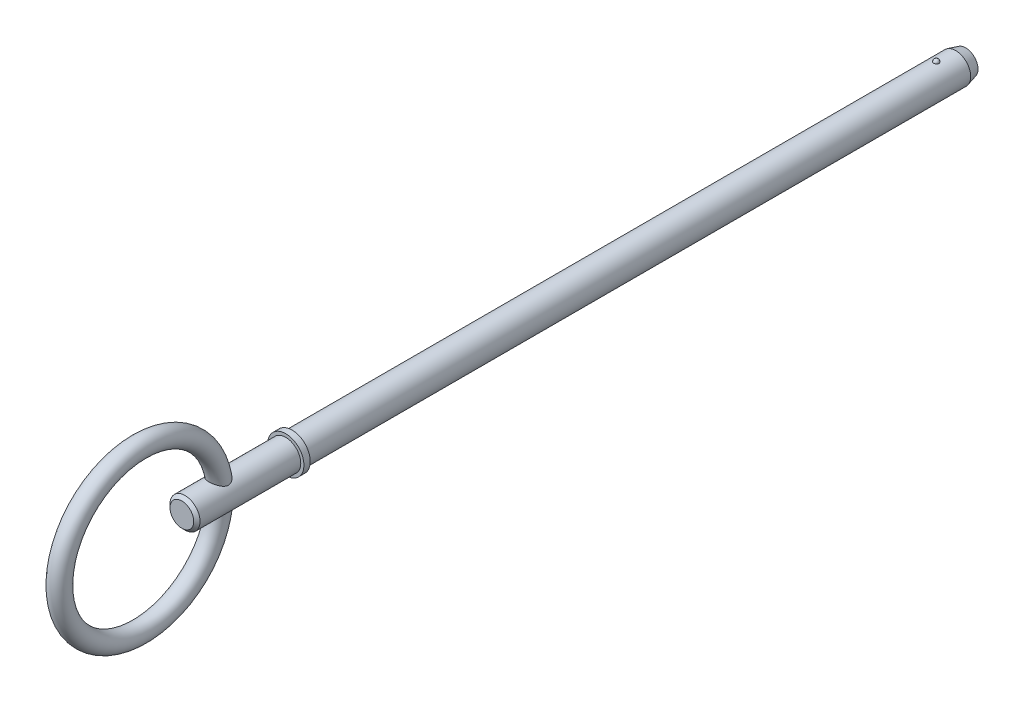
ISO-10303-21;
HEADER;
FILE_DESCRIPTION(('STEP AP214'),'2;1');
FILE_NAME('part.step','',(''),(''),'','','');
FILE_SCHEMA(('AUTOMOTIVE_DESIGN { 1 0 10303 214 1 1 1 1 }'));
ENDSEC;
DATA;
#1=APPLICATION_CONTEXT('core data for automotive mechanical design processes');
#2=APPLICATION_PROTOCOL_DEFINITION('international standard','automotive_design',2000,#1);
#3=PRODUCT_CONTEXT('',#1,'mechanical');
#4=PRODUCT('Part','Part','',(#3));
#5=PRODUCT_RELATED_PRODUCT_CATEGORY('part','',(#4));
#6=PRODUCT_DEFINITION_FORMATION('','',#4);
#7=PRODUCT_DEFINITION_CONTEXT('part definition',#1,'design');
#8=PRODUCT_DEFINITION('design','',#6,#7);
#9=PRODUCT_DEFINITION_SHAPE('','',#8);
#10=(LENGTH_UNIT() NAMED_UNIT(*) SI_UNIT(.MILLI.,.METRE.));
#11=(NAMED_UNIT(*) PLANE_ANGLE_UNIT() SI_UNIT($,.RADIAN.));
#12=(NAMED_UNIT(*) SI_UNIT($,.STERADIAN.) SOLID_ANGLE_UNIT());
#13=UNCERTAINTY_MEASURE_WITH_UNIT(LENGTH_MEASURE(1.E-05),#10,'distance_accuracy_value','');
#14=(GEOMETRIC_REPRESENTATION_CONTEXT(3) GLOBAL_UNCERTAINTY_ASSIGNED_CONTEXT((#13)) GLOBAL_UNIT_ASSIGNED_CONTEXT((#10,
#11,#12)) REPRESENTATION_CONTEXT('',''));
#15=CARTESIAN_POINT('',(0.,0.,0.));
#16=DIRECTION('',(0.,0.,1.));
#17=DIRECTION('',(1.,0.,0.));
#18=AXIS2_PLACEMENT_3D('',#15,#16,#17);
#19=CARTESIAN_POINT('',(0.,0.,101.6));
#20=DIRECTION('',(0.,0.,-1.));
#21=DIRECTION('',(-1.,0.,0.));
#22=AXIS2_PLACEMENT_3D('',#19,#20,#21);
#23=CYLINDRICAL_SURFACE('',#22,2.38);
#24=CARTESIAN_POINT('',(0.418361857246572,2.34294117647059,-0.419999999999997));
#25=CARTESIAN_POINT('',(0.418361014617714,2.34294160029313,-0.396453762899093));
#26=CARTESIAN_POINT('',(0.416399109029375,2.34329426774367,-0.372895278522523));
#27=CARTESIAN_POINT('',(0.408599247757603,2.34466666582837,-0.32643458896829));
#28=CARTESIAN_POINT('',(0.402757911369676,2.34568697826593,-0.303532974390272));
#29=CARTESIAN_POINT('',(0.387358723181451,2.3482789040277,-0.259059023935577));
#30=CARTESIAN_POINT('',(0.377802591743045,2.34985026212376,-0.237486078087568));
#31=CARTESIAN_POINT('',(0.355233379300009,2.35336760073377,-0.196270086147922));
#32=CARTESIAN_POINT('',(0.34222083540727,2.3553135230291,-0.176626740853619));
#33=CARTESIAN_POINT('',(0.313060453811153,2.35936636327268,-0.139777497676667));
#34=CARTESIAN_POINT('',(0.296906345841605,2.36147359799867,-0.122576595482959));
#35=CARTESIAN_POINT('',(0.261921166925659,2.3656092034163,-0.0911421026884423));
#36=CARTESIAN_POINT('',(0.243090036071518,2.36763757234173,-0.0769085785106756));
#37=CARTESIAN_POINT('',(0.203297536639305,2.37138533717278,-0.0518262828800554));
#38=CARTESIAN_POINT('',(0.182338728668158,2.37310509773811,-0.0409735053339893));
#39=CARTESIAN_POINT('',(0.138864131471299,2.37604521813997,-0.0229395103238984));
#40=CARTESIAN_POINT('',(0.116348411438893,2.37726560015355,-0.0157581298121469));
#41=CARTESIAN_POINT('',(0.0705754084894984,2.37906276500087,-0.00531205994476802));
#42=CARTESIAN_POINT('',(0.0473247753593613,2.37964420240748,-0.00201903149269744));
#43=CARTESIAN_POINT('',(0.000593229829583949,2.38011460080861,0.000651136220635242));
#44=CARTESIAN_POINT('',(-0.0228876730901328,2.38000359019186,2.84360175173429E-05));
#45=CARTESIAN_POINT('',(-0.0692686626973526,2.37910422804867,-0.00509943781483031));
#46=CARTESIAN_POINT('',(-0.0921713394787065,2.37831983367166,-0.00958192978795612));
#47=CARTESIAN_POINT('',(-0.136890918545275,2.37616546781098,-0.022272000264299));
#48=CARTESIAN_POINT('',(-0.158707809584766,2.37479549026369,-0.0304796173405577));
#49=CARTESIAN_POINT('',(-0.200704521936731,2.37161607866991,-0.0504168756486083));
#50=CARTESIAN_POINT('',(-0.220879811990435,2.36980547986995,-0.0621558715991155));
#51=CARTESIAN_POINT('',(-0.258974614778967,2.36594575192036,-0.0888218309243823));
#52=CARTESIAN_POINT('',(-0.276894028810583,2.36389661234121,-0.103748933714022));
#53=CARTESIAN_POINT('',(-0.310124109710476,2.35976825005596,-0.136509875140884));
#54=CARTESIAN_POINT('',(-0.325413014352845,2.35768891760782,-0.154365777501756));
#55=CARTESIAN_POINT('',(-0.352793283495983,2.35374782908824,-0.192402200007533));
#56=CARTESIAN_POINT('',(-0.364884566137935,2.35188607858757,-0.212582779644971));
#57=CARTESIAN_POINT('',(-0.385587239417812,2.34858114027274,-0.254794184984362));
#58=CARTESIAN_POINT('',(-0.394183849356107,2.34713973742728,-0.276832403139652));
#59=CARTESIAN_POINT('',(-0.407590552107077,2.3448489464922,-0.322061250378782));
#60=CARTESIAN_POINT('',(-0.412400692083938,2.34399955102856,-0.34525186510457));
#61=CARTESIAN_POINT('',(-0.418098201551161,2.34299005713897,-0.392078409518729));
#62=CARTESIAN_POINT('',(-0.41899328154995,2.34282860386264,-0.415713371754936));
#63=CARTESIAN_POINT('',(-0.416857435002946,2.34320955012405,-0.462799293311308));
#64=CARTESIAN_POINT('',(-0.413826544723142,2.34375194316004,-0.486250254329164));
#65=CARTESIAN_POINT('',(-0.403929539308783,2.34547773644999,-0.532261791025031));
#66=CARTESIAN_POINT('',(-0.397069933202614,2.34666004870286,-0.554823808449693));
#67=CARTESIAN_POINT('',(-0.379705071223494,2.34953208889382,-0.59846383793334));
#68=CARTESIAN_POINT('',(-0.369199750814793,2.35122182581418,-0.61954182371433));
#69=CARTESIAN_POINT('',(-0.344797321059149,2.35492396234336,-0.659671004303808));
#70=CARTESIAN_POINT('',(-0.33089223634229,2.35693711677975,-0.678717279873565));
#71=CARTESIAN_POINT('',(-0.300080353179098,2.36105754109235,-0.714192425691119));
#72=CARTESIAN_POINT('',(-0.283173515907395,2.36316481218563,-0.730621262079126));
#73=CARTESIAN_POINT('',(-0.246801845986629,2.36723962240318,-0.760416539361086));
#74=CARTESIAN_POINT('',(-0.227334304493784,2.36920701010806,-0.773779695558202));
#75=CARTESIAN_POINT('',(-0.186398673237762,2.37277833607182,-0.797042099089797));
#76=CARTESIAN_POINT('',(-0.164930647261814,2.37438228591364,-0.806941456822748));
#77=CARTESIAN_POINT('',(-0.120727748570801,2.37703848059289,-0.82294821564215));
#78=CARTESIAN_POINT('',(-0.0980005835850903,2.37809374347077,-0.829076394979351));
#79=CARTESIAN_POINT('',(-0.0518218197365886,2.37954782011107,-0.837451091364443));
#80=CARTESIAN_POINT('',(-0.0283702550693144,2.37994666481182,-0.839697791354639));
#81=CARTESIAN_POINT('',(0.0184023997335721,2.38004290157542,-0.840243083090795));
#82=CARTESIAN_POINT('',(0.0417231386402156,2.37974556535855,-0.838571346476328));
#83=CARTESIAN_POINT('',(0.0877471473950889,2.37849333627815,-0.831389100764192));
#84=CARTESIAN_POINT('',(0.110450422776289,2.37753844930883,-0.825878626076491));
#85=CARTESIAN_POINT('',(0.154584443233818,2.37507730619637,-0.811179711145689));
#86=CARTESIAN_POINT('',(0.17601599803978,2.37357140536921,-0.801993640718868));
#87=CARTESIAN_POINT('',(0.217028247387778,2.37017355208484,-0.780200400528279));
#88=CARTESIAN_POINT('',(0.236608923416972,2.36828159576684,-0.767593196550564));
#89=CARTESIAN_POINT('',(0.27351405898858,2.36430486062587,-0.739207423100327));
#90=CARTESIAN_POINT('',(0.290821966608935,2.36221883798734,-0.723407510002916));
#91=CARTESIAN_POINT('',(0.322554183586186,2.3580957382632,-0.68912612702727));
#92=CARTESIAN_POINT('',(0.336977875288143,2.35605867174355,-0.670644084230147));
#93=CARTESIAN_POINT('',(0.362636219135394,2.35224677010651,-0.63138169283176));
#94=CARTESIAN_POINT('',(0.373848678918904,2.35047379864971,-0.610586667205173));
#95=CARTESIAN_POINT('',(0.392641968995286,2.34740786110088,-0.567397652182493));
#96=CARTESIAN_POINT('',(0.400225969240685,2.34611447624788,-0.545005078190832));
#97=CARTESIAN_POINT('',(0.410033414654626,2.34441668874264,-0.505456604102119));
#98=CARTESIAN_POINT('',(0.413152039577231,2.34386644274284,-0.488523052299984));
#99=CARTESIAN_POINT('',(0.417316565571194,2.34312853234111,-0.454395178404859));
#100=CARTESIAN_POINT('',(0.418362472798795,2.34294086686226,-0.437200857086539));
#101=CARTESIAN_POINT('',(0.418361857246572,2.34294117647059,-0.419999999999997));
#102=B_SPLINE_CURVE_WITH_KNOTS('',3,(#24,#25,#26,#27,#28,#29,#30,#31,#32,#33,#34,#35,#36,#37,
#38,#39,#40,#41,#42,#43,#44,#45,#46,#47,#48,#49,#50,#51,#52,#53,#54,#55,#56,#57,#58,#59,#60,#61,
#62,#63,#64,#65,#66,#67,#68,#69,#70,#71,#72,#73,#74,#75,#76,#77,#78,#79,#80,#81,#82,#83,#84,#85,
#86,#87,#88,#89,#90,#91,#92,#93,#94,#95,#96,#97,#98,#99,#100,#101),.UNSPECIFIED.,.T.,.F.,(4,2,2,
2,2,2,2,2,2,2,2,2,2,2,2,2,2,2,2,2,2,2,2,2,2,2,2,2,2,2,2,2,2,2,2,2,2,2,4),(0.,0.0705763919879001,
0.141214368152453,0.211819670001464,0.282414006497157,0.353150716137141,0.423889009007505,
0.494543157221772,0.565194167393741,0.635327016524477,0.705456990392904,0.77517764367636,
0.844899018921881,0.914806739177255,0.98471751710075,1.05518143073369,1.1256471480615,
1.19640787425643,1.26716771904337,1.33778814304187,1.40840791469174,1.47890799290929,
1.54940931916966,1.62007764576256,1.69074688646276,1.76149149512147,1.83223384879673,
1.90258285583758,1.97292854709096,2.04274328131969,2.11255738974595,2.18232655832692,
2.25209642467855,2.32234913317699,2.39261687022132,2.4633591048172,2.5340394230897,
2.58559662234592,2.63715366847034),.UNSPECIFIED.);
#103=CARTESIAN_POINT('',(0.418361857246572,2.34294117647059,-0.419999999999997));
#104=VERTEX_POINT('',#103);
#105=EDGE_CURVE('E102',#104,#104,#102,.T.);
#106=ORIENTED_EDGE('',*,*,#105,.T.);
#107=EDGE_LOOP('',(#106));
#108=FACE_BOUND('',#107,.T.);
#109=CARTESIAN_POINT('',(0.,0.,-3.49399999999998));
#110=DIRECTION('',(0.,0.,-1.));
#111=DIRECTION('',(-1.,0.,0.));
#112=AXIS2_PLACEMENT_3D('',#109,#110,#111);
#113=CIRCLE('',#112,2.38);
#114=CARTESIAN_POINT('',(-2.38,0.,-3.49399999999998));
#115=VERTEX_POINT('',#114);
#116=EDGE_CURVE('E109',#115,#115,#113,.F.);
#117=ORIENTED_EDGE('',*,*,#116,.T.);
#118=EDGE_LOOP('',(#117));
#119=FACE_BOUND('',#118,.T.);
#120=CARTESIAN_POINT('',(0.,0.,101.6));
#121=DIRECTION('',(0.,0.,1.));
#122=DIRECTION('',(1.,0.,0.));
#123=AXIS2_PLACEMENT_3D('',#120,#121,#122);
#124=CIRCLE('',#123,2.38);
#125=CARTESIAN_POINT('',(2.38,0.,101.6));
#126=VERTEX_POINT('',#125);
#127=EDGE_CURVE('E107',#126,#126,#124,.T.);
#128=ORIENTED_EDGE('',*,*,#127,.F.);
#129=EDGE_LOOP('',(#128));
#130=FACE_BOUND('',#129,.T.);
#131=ADVANCED_FACE('F39',(#108,#119,#130),#23,.T.);
#132=CARTESIAN_POINT('',(0.,0.,-5.08));
#133=DIRECTION('',(0.,0.,-1.));
#134=DIRECTION('',(-1.,0.,0.));
#135=AXIS2_PLACEMENT_3D('',#132,#133,#134);
#136=PLANE('',#135);
#137=CARTESIAN_POINT('',(0.,0.,-5.08));
#138=DIRECTION('',(0.,0.,-1.));
#139=DIRECTION('',(-1.,0.,0.));
#140=AXIS2_PLACEMENT_3D('',#137,#138,#139);
#141=CIRCLE('',#140,1.95503258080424);
#142=CARTESIAN_POINT('',(-1.95503258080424,0.,-5.08));
#143=VERTEX_POINT('',#142);
#144=EDGE_CURVE('E143',#143,#143,#141,.T.);
#145=ORIENTED_EDGE('',*,*,#144,.T.);
#146=EDGE_LOOP('',(#145));
#147=FACE_BOUND('',#146,.T.);
#148=ADVANCED_FACE('F88',(#147),#136,.T.);
#149=CARTESIAN_POINT('',(0.,0.,-5.08));
#150=DIRECTION('',(0.,0.,1.));
#151=DIRECTION('',(1.,0.,0.));
#152=AXIS2_PLACEMENT_3D('',#149,#150,#151);
#153=CONICAL_SURFACE('',#152,1.95503258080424,0.261799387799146);
#154=ORIENTED_EDGE('',*,*,#116,.F.);
#155=EDGE_LOOP('',(#154));
#156=FACE_BOUND('',#155,.T.);
#157=ORIENTED_EDGE('',*,*,#144,.F.);
#158=EDGE_LOOP('',(#157));
#159=FACE_BOUND('',#158,.T.);
#160=ADVANCED_FACE('F94',(#156,#159),#153,.T.);
#161=CARTESIAN_POINT('',(0.,2.38,-0.419999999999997));
#162=DIRECTION('',(0.,1.,0.));
#163=DIRECTION('',(0.,0.,1.));
#164=AXIS2_PLACEMENT_3D('',#161,#162,#163);
#165=SPHERICAL_SURFACE('',#164,0.419999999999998);
#166=ORIENTED_EDGE('',*,*,#105,.F.);
#167=EDGE_LOOP('',(#166));
#168=FACE_BOUND('',#167,.T.);
#169=ADVANCED_FACE('F112',(#168),#165,.T.);
#170=CARTESIAN_POINT('',(0.,0.,101.6));
#171=DIRECTION('',(0.,0.,-1.));
#172=DIRECTION('',(-1.,0.,0.));
#173=AXIS2_PLACEMENT_3D('',#170,#171,#172);
#174=PLANE('',#173);
#175=ORIENTED_EDGE('',*,*,#127,.T.);
#176=EDGE_LOOP('',(#175));
#177=FACE_BOUND('',#176,.T.);
#178=CARTESIAN_POINT('',(0.,0.,101.6));
#179=DIRECTION('',(0.,0.,-1.));
#180=DIRECTION('',(-1.,0.,0.));
#181=AXIS2_PLACEMENT_3D('',#178,#179,#180);
#182=CIRCLE('',#181,2.88);
#183=CARTESIAN_POINT('',(-2.88,0.,101.6));
#184=VERTEX_POINT('',#183);
#185=EDGE_CURVE('E108',#184,#184,#182,.T.);
#186=ORIENTED_EDGE('',*,*,#185,.T.);
#187=EDGE_LOOP('',(#186));
#188=FACE_BOUND('',#187,.T.);
#189=ADVANCED_FACE('F116',(#177,#188),#174,.T.);
#190=CARTESIAN_POINT('',(0.,0.,33.7287874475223));
#191=DIRECTION('',(0.,0.,-1.));
#192=DIRECTION('',(-1.,0.,0.));
#193=AXIS2_PLACEMENT_3D('',#190,#191,#192);
#194=CYLINDRICAL_SURFACE('',#193,2.88);
#195=CARTESIAN_POINT('',(0.,0.,102.6));
#196=DIRECTION('',(0.,0.,-1.));
#197=DIRECTION('',(-1.,0.,0.));
#198=AXIS2_PLACEMENT_3D('',#195,#196,#197);
#199=CIRCLE('',#198,2.88);
#200=CARTESIAN_POINT('',(-2.88,0.,102.6));
#201=VERTEX_POINT('',#200);
#202=EDGE_CURVE('E133',#201,#201,#199,.T.);
#203=ORIENTED_EDGE('',*,*,#202,.T.);
#204=EDGE_LOOP('',(#203));
#205=FACE_BOUND('',#204,.T.);
#206=ORIENTED_EDGE('',*,*,#185,.F.);
#207=EDGE_LOOP('',(#206));
#208=FACE_BOUND('',#207,.T.);
#209=ADVANCED_FACE('F120',(#205,#208),#194,.T.);
#210=CARTESIAN_POINT('',(0.,2.88,102.6));
#211=DIRECTION('',(0.,0.,1.));
#212=DIRECTION('',(1.,0.,0.));
#213=AXIS2_PLACEMENT_3D('',#210,#211,#212);
#214=PLANE('',#213);
#215=CARTESIAN_POINT('',(0.,0.,102.6));
#216=DIRECTION('',(0.,0.,1.));
#217=DIRECTION('',(1.,0.,0.));
#218=AXIS2_PLACEMENT_3D('',#215,#216,#217);
#219=CIRCLE('',#218,2.38);
#220=CARTESIAN_POINT('',(2.38,0.,102.6));
#221=VERTEX_POINT('',#220);
#222=EDGE_CURVE('E111',#221,#221,#219,.T.);
#223=ORIENTED_EDGE('',*,*,#222,.F.);
#224=EDGE_LOOP('',(#223));
#225=FACE_BOUND('',#224,.T.);
#226=ORIENTED_EDGE('',*,*,#202,.F.);
#227=EDGE_LOOP('',(#226));
#228=FACE_BOUND('',#227,.T.);
#229=ADVANCED_FACE('F85',(#225,#228),#214,.T.);
#230=CARTESIAN_POINT('',(0.,0.,119.05));
#231=DIRECTION('',(0.,0.,-1.));
#232=DIRECTION('',(-1.,0.,0.));
#233=AXIS2_PLACEMENT_3D('',#230,#231,#232);
#234=CYLINDRICAL_SURFACE('',#233,2.38);
#235=CARTESIAN_POINT('',(-0.903407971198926,-2.20187511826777,112.028101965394));
#236=CARTESIAN_POINT('',(-0.839710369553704,-2.22800560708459,111.983627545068));
#237=CARTESIAN_POINT('',(-0.771955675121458,-2.25255828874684,111.943920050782));
#238=CARTESIAN_POINT('',(-0.629623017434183,-2.29641711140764,111.874900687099));
#239=CARTESIAN_POINT('',(-0.555034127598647,-2.31571464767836,111.845605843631));
#240=CARTESIAN_POINT('',(-0.400673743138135,-2.34735542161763,111.798294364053));
#241=CARTESIAN_POINT('',(-0.320887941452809,-2.35967847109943,111.78031045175));
#242=CARTESIAN_POINT('',(-0.158738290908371,-2.37609587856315,111.756461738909));
#243=CARTESIAN_POINT('',(-0.0763765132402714,-2.38019668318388,111.75058744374));
#244=CARTESIAN_POINT('',(0.0836658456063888,-2.3797998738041,111.751160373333));
#245=CARTESIAN_POINT('',(0.161351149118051,-2.37576936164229,111.756938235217));
#246=CARTESIAN_POINT('',(0.314409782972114,-2.36039486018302,111.779267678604));
#247=CARTESIAN_POINT('',(0.3897828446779,-2.34905002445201,111.795820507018));
#248=CARTESIAN_POINT('',(0.535937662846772,-2.32006569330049,111.839051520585));
#249=CARTESIAN_POINT('',(0.606735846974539,-2.30245039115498,111.865690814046));
#250=CARTESIAN_POINT('',(0.742521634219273,-2.26231731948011,111.928372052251));
#251=CARTESIAN_POINT('',(0.807508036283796,-2.23979853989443,111.96441593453));
#252=CARTESIAN_POINT('',(0.935326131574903,-2.18966592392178,112.048356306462));
#253=CARTESIAN_POINT('',(0.997591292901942,-2.16179128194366,112.096959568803));
#254=CARTESIAN_POINT('',(1.11292144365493,-2.10474548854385,112.203560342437));
#255=CARTESIAN_POINT('',(1.16597568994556,-2.07557287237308,112.261568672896));
#256=CARTESIAN_POINT('',(1.26477130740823,-2.01699124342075,112.390297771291));
#257=CARTESIAN_POINT('',(1.30983402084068,-1.98768494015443,112.46159201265));
#258=CARTESIAN_POINT('',(1.38660631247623,-1.93491744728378,112.612963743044));
#259=CARTESIAN_POINT('',(1.41834090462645,-1.91144534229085,112.693024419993));
#260=CARTESIAN_POINT('',(1.46422131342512,-1.87648847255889,112.850694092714));
#261=CARTESIAN_POINT('',(1.47990731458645,-1.86397592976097,112.927619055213));
#262=CARTESIAN_POINT('',(1.49871691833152,-1.84889326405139,113.083897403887));
#263=CARTESIAN_POINT('',(1.50185388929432,-1.84631256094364,113.163248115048));
#264=CARTESIAN_POINT('',(1.4964844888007,-1.85065563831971,113.308847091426));
#265=CARTESIAN_POINT('',(1.48970686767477,-1.85616871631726,113.37522048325));
#266=CARTESIAN_POINT('',(1.46828795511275,-1.87315650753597,113.505907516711));
#267=CARTESIAN_POINT('',(1.4536391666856,-1.88463690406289,113.570219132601));
#268=CARTESIAN_POINT('',(1.40943250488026,-1.91806137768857,113.723064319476));
#269=CARTESIAN_POINT('',(1.37616344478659,-1.94238425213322,113.809999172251));
#270=CARTESIAN_POINT('',(1.29708737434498,-1.99605834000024,113.976348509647));
#271=CARTESIAN_POINT('',(1.25125268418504,-2.02542060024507,114.055745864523));
#272=CARTESIAN_POINT('',(1.14695036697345,-2.08629729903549,114.207628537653));
#273=CARTESIAN_POINT('',(1.08823347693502,-2.11784433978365,114.279929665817));
#274=CARTESIAN_POINT('',(0.959228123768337,-2.17930599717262,114.414070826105));
#275=CARTESIAN_POINT('',(0.888958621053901,-2.20922318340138,114.475927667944));
#276=CARTESIAN_POINT('',(0.753368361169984,-2.25851185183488,114.574933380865));
#277=CARTESIAN_POINT('',(0.690173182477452,-2.2787729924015,114.61453921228));
#278=CARTESIAN_POINT('',(0.557409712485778,-2.31482439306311,114.683984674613));
#279=CARTESIAN_POINT('',(0.487846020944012,-2.33061784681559,114.713831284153));
#280=CARTESIAN_POINT('',(0.342953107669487,-2.35631858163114,114.762025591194));
#281=CARTESIAN_POINT('',(0.26757466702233,-2.36616750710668,114.780259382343));
#282=CARTESIAN_POINT('',(0.114199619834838,-2.37849775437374,114.803046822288));
#283=CARTESIAN_POINT('',(0.0362059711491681,-2.3809871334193,114.807615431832));
#284=CARTESIAN_POINT('',(-0.107568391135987,-2.37849121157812,114.80301636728));
#285=CARTESIAN_POINT('',(-0.173440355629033,-2.37456249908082,114.795790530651));
#286=CARTESIAN_POINT('',(-0.302853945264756,-2.36154811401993,114.771690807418));
#287=CARTESIAN_POINT('',(-0.366395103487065,-2.35246141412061,114.754814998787));
#288=CARTESIAN_POINT('',(-0.489880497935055,-2.32988758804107,114.712434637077));
#289=CARTESIAN_POINT('',(-0.549812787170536,-2.31638670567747,114.68690310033));
#290=CARTESIAN_POINT('',(-0.665021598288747,-2.28597979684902,114.628489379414));
#291=CARTESIAN_POINT('',(-0.720295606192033,-2.26907194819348,114.595603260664));
#292=CARTESIAN_POINT('',(-0.8511327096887,-2.22413718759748,114.506311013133));
#293=CARTESIAN_POINT('',(-0.923680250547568,-2.19467168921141,114.446196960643));
#294=CARTESIAN_POINT('',(-1.05722916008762,-2.13356097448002,114.315066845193));
#295=CARTESIAN_POINT('',(-1.1182007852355,-2.10191042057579,114.244023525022));
#296=CARTESIAN_POINT('',(-1.22894457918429,-2.0391654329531,114.091611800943));
#297=CARTESIAN_POINT('',(-1.27853191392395,-2.00808682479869,114.010102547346));
#298=CARTESIAN_POINT('',(-1.36422650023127,-1.95088121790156,113.838753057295));
#299=CARTESIAN_POINT('',(-1.40036235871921,-1.9247437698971,113.748931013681));
#300=CARTESIAN_POINT('',(-1.44943039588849,-1.88791548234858,113.587739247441));
#301=CARTESIAN_POINT('',(-1.46600167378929,-1.87495651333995,113.518005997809));
#302=CARTESIAN_POINT('',(-1.48984634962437,-1.8560704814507,113.376055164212));
#303=CARTESIAN_POINT('',(-1.49713400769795,-1.85013263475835,113.303841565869));
#304=CARTESIAN_POINT('',(-1.5014924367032,-1.84660099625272,113.158363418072));
#305=CARTESIAN_POINT('',(-1.4984943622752,-1.84906342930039,113.085095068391));
#306=CARTESIAN_POINT('',(-1.48179888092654,-1.8624661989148,112.94056804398));
#307=CARTESIAN_POINT('',(-1.46809860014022,-1.87340881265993,112.869309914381));
#308=CARTESIAN_POINT('',(-1.43218989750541,-1.90096973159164,112.737281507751));
#309=CARTESIAN_POINT('',(-1.410850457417,-1.91699396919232,112.676142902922));
#310=CARTESIAN_POINT('',(-1.36038958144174,-1.95312601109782,112.558438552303));
#311=CARTESIAN_POINT('',(-1.33126141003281,-1.97323734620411,112.5018768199));
#312=CARTESIAN_POINT('',(-1.2617310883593,-2.0185059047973,112.38705007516));
#313=CARTESIAN_POINT('',(-1.22036168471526,-2.04397945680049,112.329498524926));
#314=CARTESIAN_POINT('',(-1.1295425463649,-2.09553139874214,112.221648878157));
#315=CARTESIAN_POINT('',(-1.08010424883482,-2.12160888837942,112.171340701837));
#316=CARTESIAN_POINT('',(-0.987769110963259,-2.16578285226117,112.090484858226));
#317=CARTESIAN_POINT('',(-0.946517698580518,-2.18419033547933,112.05820168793));
#318=CARTESIAN_POINT('',(-0.903407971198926,-2.20187511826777,112.028101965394));
#319=B_SPLINE_CURVE_WITH_KNOTS('',3,(#235,#236,#237,#238,#239,#240,#241,#242,#243,#244,#245,
#246,#247,#248,#249,#250,#251,#252,#253,#254,#255,#256,#257,#258,#259,#260,#261,#262,#263,#264,
#265,#266,#267,#268,#269,#270,#271,#272,#273,#274,#275,#276,#277,#278,#279,#280,#281,#282,#283,
#284,#285,#286,#287,#288,#289,#290,#291,#292,#293,#294,#295,#296,#297,#298,#299,#300,#301,#302,
#303,#304,#305,#306,#307,#308,#309,#310,#311,#312,#313,#314,#315,#316,#317,#318),.UNSPECIFIED.,
.T.,.F.,(4,2,2,2,2,2,2,2,2,2,2,2,2,2,2,2,2,2,2,2,2,2,2,2,2,2,2,2,2,2,2,2,2,2,2,2,2,2,2,2,2,4),
(0.,0.245727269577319,0.49185450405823,0.738690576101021,0.985333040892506,1.21821047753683,
1.45111486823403,1.68313021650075,1.9151934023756,2.16541572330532,2.41592795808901,
2.68235417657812,2.9482781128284,3.18521517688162,3.42189976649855,3.62191159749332,
3.82211427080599,4.1091894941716,4.39690224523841,4.69076958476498,4.98415935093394,
5.2151557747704,5.4459866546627,5.67904815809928,5.91185441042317,6.11003726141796,
6.30825959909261,6.50710565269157,6.70605834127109,7.00062466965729,7.29593791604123,
7.59575158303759,7.89492395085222,8.11262207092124,8.32998539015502,8.54880641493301,
8.76768621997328,8.9670210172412,9.16652875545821,9.39164791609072,9.61645071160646,
9.78275580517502),.UNSPECIFIED.);
#320=CARTESIAN_POINT('',(-0.903407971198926,-2.20187511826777,112.028101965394));
#321=VERTEX_POINT('',#320);
#322=EDGE_CURVE('E10',#321,#321,#319,.T.);
#323=ORIENTED_EDGE('',*,*,#322,.F.);
#324=EDGE_LOOP('',(#323));
#325=FACE_BOUND('',#324,.T.);
#326=CARTESIAN_POINT('',(-0.903407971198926,2.20187511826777,112.028101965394));
#327=CARTESIAN_POINT('',(-0.970214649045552,2.17445928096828,112.074755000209));
#328=CARTESIAN_POINT('',(-1.03268838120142,2.14525344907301,112.126744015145));
#329=CARTESIAN_POINT('',(-1.1477077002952,2.0859961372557,112.240647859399));
#330=CARTESIAN_POINT('',(-1.20022114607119,2.05594226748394,112.302593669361));
#331=CARTESIAN_POINT('',(-1.2941155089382,1.99817720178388,112.435926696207));
#332=CARTESIAN_POINT('',(-1.33544720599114,1.9704767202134,112.507353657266));
#333=CARTESIAN_POINT('',(-1.40506760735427,1.92146090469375,112.658202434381));
#334=CARTESIAN_POINT('',(-1.43339046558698,1.90012890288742,112.737602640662));
#335=CARTESIAN_POINT('',(-1.47338334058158,1.86925714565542,112.893449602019));
#336=CARTESIAN_POINT('',(-1.48649837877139,1.85870842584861,112.969319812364));
#337=CARTESIAN_POINT('',(-1.50071746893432,1.8472518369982,113.12287045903));
#338=CARTESIAN_POINT('',(-1.50182784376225,1.84633889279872,113.200549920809));
#339=CARTESIAN_POINT('',(-1.49326645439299,1.85325786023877,113.343985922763));
#340=CARTESIAN_POINT('',(-1.48506604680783,1.85989666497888,113.409904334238));
#341=CARTESIAN_POINT('',(-1.46099386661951,1.87886395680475,113.539479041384));
#342=CARTESIAN_POINT('',(-1.44511553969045,1.8911973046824,113.603133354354));
#343=CARTESIAN_POINT('',(-1.39754250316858,1.92678855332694,113.756153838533));
#344=CARTESIAN_POINT('',(-1.36192725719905,1.95245999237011,113.84373726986));
#345=CARTESIAN_POINT('',(-1.27788657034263,2.00847209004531,114.010990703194));
#346=CARTESIAN_POINT('',(-1.22943137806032,2.0388235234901,114.09064172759));
#347=CARTESIAN_POINT('',(-1.11958027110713,2.10119412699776,114.242420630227));
#348=CARTESIAN_POINT('',(-1.05794784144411,2.13323438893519,114.314369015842));
#349=CARTESIAN_POINT('',(-0.922772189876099,2.1950849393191,114.447080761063));
#350=CARTESIAN_POINT('',(-0.849252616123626,2.22489948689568,114.507865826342));
#351=CARTESIAN_POINT('',(-0.710152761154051,2.27246326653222,114.602311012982));
#352=CARTESIAN_POINT('',(-0.647015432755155,2.29138112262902,114.638970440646));
#353=CARTESIAN_POINT('',(-0.514878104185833,2.32463484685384,114.702588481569));
#354=CARTESIAN_POINT('',(-0.445882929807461,2.33897444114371,114.72955498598));
#355=CARTESIAN_POINT('',(-0.302797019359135,2.36177853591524,114.772162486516));
#356=CARTESIAN_POINT('',(-0.228666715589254,2.37019011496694,114.787701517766));
#357=CARTESIAN_POINT('',(-0.0783799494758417,2.37989644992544,114.805616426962));
#358=CARTESIAN_POINT('',(-0.00222521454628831,2.38119708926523,114.808003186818));
#359=CARTESIAN_POINT('',(0.138818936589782,2.37685303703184,114.799998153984));
#360=CARTESIAN_POINT('',(0.203841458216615,2.37212211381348,114.791287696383));
#361=CARTESIAN_POINT('',(0.331347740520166,2.35769527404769,114.76453097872));
#362=CARTESIAN_POINT('',(0.393830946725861,2.34799827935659,114.746482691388));
#363=CARTESIAN_POINT('',(0.516206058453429,2.32419976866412,114.701683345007));
#364=CARTESIAN_POINT('',(0.576015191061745,2.31000942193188,114.67475627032));
#365=CARTESIAN_POINT('',(0.690806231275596,2.27831963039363,114.613611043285));
#366=CARTESIAN_POINT('',(0.745785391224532,2.26081831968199,114.579388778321));
#367=CARTESIAN_POINT('',(0.876071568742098,2.2144370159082,114.486610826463));
#368=CARTESIAN_POINT('',(0.94823603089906,2.18416686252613,114.424322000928));
#369=CARTESIAN_POINT('',(1.08068664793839,2.121767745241,114.288804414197));
#370=CARTESIAN_POINT('',(1.14094076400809,2.08963406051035,114.215547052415));
#371=CARTESIAN_POINT('',(1.24978363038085,2.02643655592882,114.058659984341));
#372=CARTESIAN_POINT('',(1.29819307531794,1.99539463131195,113.97489682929));
#373=CARTESIAN_POINT('',(1.38094965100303,1.93904233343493,113.79899624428));
#374=CARTESIAN_POINT('',(1.41533296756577,1.91371728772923,113.706881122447));
#375=CARTESIAN_POINT('',(1.46011713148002,1.87962907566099,113.543926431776));
#376=CARTESIAN_POINT('',(1.47459501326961,1.86818653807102,113.474777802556));
#377=CARTESIAN_POINT('',(1.49436605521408,1.8524142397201,113.334403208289));
#378=CARTESIAN_POINT('',(1.49967306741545,1.84807375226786,113.263180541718));
#379=CARTESIAN_POINT('',(1.50029887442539,1.84756805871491,113.120229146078));
#380=CARTESIAN_POINT('',(1.49556248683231,1.8514480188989,113.048499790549));
#381=CARTESIAN_POINT('',(1.47581657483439,1.86722196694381,112.907351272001));
#382=CARTESIAN_POINT('',(1.46080121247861,1.87912050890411,112.837933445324));
#383=CARTESIAN_POINT('',(1.42246467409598,1.90827733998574,112.708219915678));
#384=CARTESIAN_POINT('',(1.39980172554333,1.92509995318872,112.647626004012));
#385=CARTESIAN_POINT('',(1.34679091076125,1.96255086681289,112.531185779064));
#386=CARTESIAN_POINT('',(1.31644034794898,1.98318050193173,112.475341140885));
#387=CARTESIAN_POINT('',(1.24396057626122,2.02954647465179,112.361451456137));
#388=CARTESIAN_POINT('',(1.20077385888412,2.05559269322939,112.304206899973));
#389=CARTESIAN_POINT('',(1.10616417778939,2.10801594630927,112.197132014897));
#390=CARTESIAN_POINT('',(1.05473535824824,2.13439320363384,112.147307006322));
#391=CARTESIAN_POINT('',(0.936202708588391,2.18924478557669,112.048734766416));
#392=CARTESIAN_POINT('',(0.8679049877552,2.21744450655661,112.001258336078));
#393=CARTESIAN_POINT('',(0.722917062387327,2.26885521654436,111.917749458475));
#394=CARTESIAN_POINT('',(0.646227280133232,2.29206645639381,111.881716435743));
#395=CARTESIAN_POINT('',(0.487515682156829,2.33094430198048,111.822591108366));
#396=CARTESIAN_POINT('',(0.405587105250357,2.34671524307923,111.799319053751));
#397=CARTESIAN_POINT('',(0.237955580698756,2.36958127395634,111.765852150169));
#398=CARTESIAN_POINT('',(0.152255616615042,2.37668309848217,111.755647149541));
#399=CARTESIAN_POINT('',(-0.012299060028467,2.38126478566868,111.749050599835));
#400=CARTESIAN_POINT('',(-0.0910885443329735,2.37954037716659,111.751516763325));
#401=CARTESIAN_POINT('',(-0.247004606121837,2.36843740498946,111.767569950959));
#402=CARTESIAN_POINT('',(-0.324130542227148,2.35905594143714,111.781161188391));
#403=CARTESIAN_POINT('',(-0.473048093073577,2.33371594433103,111.818598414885));
#404=CARTESIAN_POINT('',(-0.544914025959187,2.31788812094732,111.842240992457));
#405=CARTESIAN_POINT('',(-0.683201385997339,2.28095222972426,111.899026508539));
#406=CARTESIAN_POINT('',(-0.749631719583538,2.25985303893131,111.932153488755));
#407=CARTESIAN_POINT('',(-0.843767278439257,2.22565914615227,111.988072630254));
#408=CARTESIAN_POINT('',(-0.8740072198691,2.21394047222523,112.007570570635));
#409=CARTESIAN_POINT('',(-0.903407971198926,2.20187511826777,112.028101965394));
#410=B_SPLINE_CURVE_WITH_KNOTS('',3,(#326,#327,#328,#329,#330,#331,#332,#333,#334,#335,#336,
#337,#338,#339,#340,#341,#342,#343,#344,#345,#346,#347,#348,#349,#350,#351,#352,#353,#354,#355,
#356,#357,#358,#359,#360,#361,#362,#363,#364,#365,#366,#367,#368,#369,#370,#371,#372,#373,#374,
#375,#376,#377,#378,#379,#380,#381,#382,#383,#384,#385,#386,#387,#388,#389,#390,#391,#392,#393,
#394,#395,#396,#397,#398,#399,#400,#401,#402,#403,#404,#405,#406,#407,#408,#409),.UNSPECIFIED.,
.T.,.F.,(4,2,2,2,2,2,2,2,2,2,2,2,2,2,2,2,2,2,2,2,2,2,2,2,2,2,2,2,2,2,2,2,2,2,2,2,2,2,2,2,2,4),
(0.,0.25781569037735,0.516449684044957,0.776204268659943,1.03527292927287,1.26692758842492,
1.49846022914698,1.69794041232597,1.89759118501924,2.1899309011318,2.48295401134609,
2.78175997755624,3.07997865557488,3.30539912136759,3.53063565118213,3.75785831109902,
3.98489294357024,4.1812829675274,4.37771564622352,4.57830350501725,4.77900474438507,
5.07746482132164,5.37671714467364,5.68025255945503,5.98299985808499,6.19688795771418,
6.41045270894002,6.62519390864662,6.84005717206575,7.03981304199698,7.23963907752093,
7.46764796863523,7.69581957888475,7.9580466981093,8.22026062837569,8.47867938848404,
8.73689726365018,8.97226876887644,9.20772945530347,9.43863631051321,9.66915690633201,
9.78261824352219),.UNSPECIFIED.);
#411=CARTESIAN_POINT('',(-0.903407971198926,2.20187511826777,112.028101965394));
#412=VERTEX_POINT('',#411);
#413=EDGE_CURVE('E51',#412,#412,#410,.T.);
#414=ORIENTED_EDGE('',*,*,#413,.F.);
#415=EDGE_LOOP('',(#414));
#416=FACE_BOUND('',#415,.T.);
#417=CARTESIAN_POINT('',(0.,0.,118.55));
#418=DIRECTION('',(0.,0.,-1.));
#419=DIRECTION('',(-1.,0.,0.));
#420=AXIS2_PLACEMENT_3D('',#417,#418,#419);
#421=CIRCLE('',#420,2.38);
#422=CARTESIAN_POINT('',(-2.38,0.,118.55));
#423=VERTEX_POINT('',#422);
#424=EDGE_CURVE('E64',#423,#423,#421,.T.);
#425=ORIENTED_EDGE('',*,*,#424,.T.);
#426=EDGE_LOOP('',(#425));
#427=FACE_BOUND('',#426,.T.);
#428=ORIENTED_EDGE('',*,*,#222,.T.);
#429=EDGE_LOOP('',(#428));
#430=FACE_BOUND('',#429,.T.);
#431=ADVANCED_FACE('F69',(#325,#416,#427,#430),#234,.T.);
#432=CARTESIAN_POINT('',(0.,0.,119.05));
#433=DIRECTION('',(0.,0.,-1.));
#434=DIRECTION('',(-1.,0.,0.));
#435=AXIS2_PLACEMENT_3D('',#432,#433,#434);
#436=PLANE('',#435);
#437=CARTESIAN_POINT('',(0.,0.,119.05));
#438=DIRECTION('',(0.,0.,-1.));
#439=DIRECTION('',(-1.,0.,0.));
#440=AXIS2_PLACEMENT_3D('',#437,#438,#439);
#441=CIRCLE('',#440,1.87999999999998);
#442=CARTESIAN_POINT('',(-1.87999999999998,0.,119.05));
#443=VERTEX_POINT('',#442);
#444=EDGE_CURVE('E58',#443,#443,#441,.F.);
#445=ORIENTED_EDGE('',*,*,#444,.T.);
#446=EDGE_LOOP('',(#445));
#447=FACE_BOUND('',#446,.T.);
#448=ADVANCED_FACE('F76',(#447),#436,.F.);
#449=CARTESIAN_POINT('',(0.,0.,118.55));
#450=DIRECTION('',(0.,0.,-1.));
#451=DIRECTION('',(-1.,0.,0.));
#452=AXIS2_PLACEMENT_3D('',#449,#450,#451);
#453=CONICAL_SURFACE('',#452,2.38,0.785398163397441);
#454=ORIENTED_EDGE('',*,*,#444,.F.);
#455=EDGE_LOOP('',(#454));
#456=FACE_BOUND('',#455,.T.);
#457=ORIENTED_EDGE('',*,*,#424,.F.);
#458=EDGE_LOOP('',(#457));
#459=FACE_BOUND('',#458,.T.);
#460=ADVANCED_FACE('F41',(#456,#459),#453,.T.);
#461=CARTESIAN_POINT('',(0.,0.,125.75));
#462=DIRECTION('',(1.,0.,0.));
#463=DIRECTION('',(0.,0.,-1.));
#464=AXIS2_PLACEMENT_3D('',#461,#462,#463);
#465=TOROIDAL_SURFACE('',#464,12.7,1.5);
#466=ORIENTED_EDGE('',*,*,#322,.T.);
#467=EDGE_LOOP('',(#466));
#468=FACE_BOUND('',#467,.T.);
#469=ORIENTED_EDGE('',*,*,#413,.T.);
#470=EDGE_LOOP('',(#469));
#471=FACE_BOUND('',#470,.T.);
#472=ADVANCED_FACE('F73',(#468,#471),#465,.T.);
#473=CLOSED_SHELL('',(#131,#148,#160,#169,#189,#209,#229,#431,#448,#460,#472));
#474=MANIFOLD_SOLID_BREP('B2',#473);
#475=ADVANCED_BREP_SHAPE_REPRESENTATION('',(#18,#474),#14);
#476=SHAPE_DEFINITION_REPRESENTATION(#9,#475);
ENDSEC;
END-ISO-10303-21;
